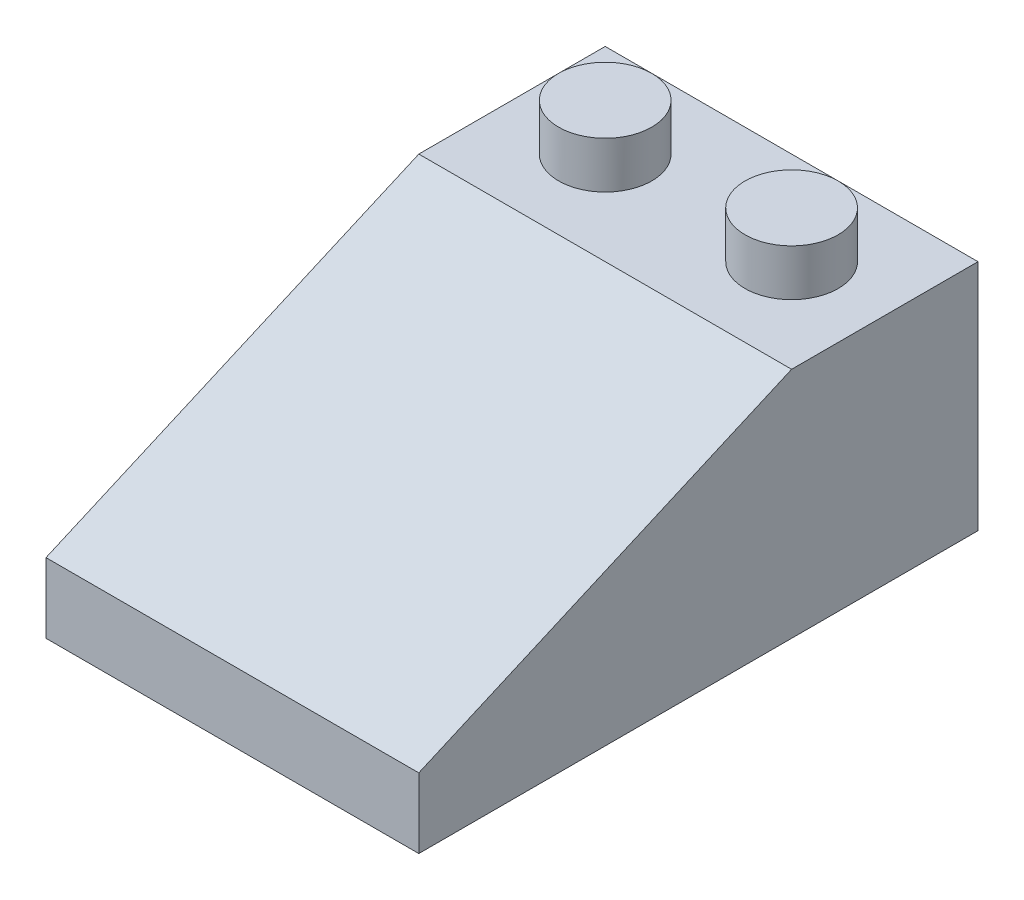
ISO-10303-21;
HEADER;
FILE_DESCRIPTION(('STEP AP214'),'2;1');
FILE_NAME('part.step','',(''),(''),'','','');
FILE_SCHEMA(('AUTOMOTIVE_DESIGN { 1 0 10303 214 1 1 1 1 }'));
ENDSEC;
DATA;
#1=APPLICATION_CONTEXT('core data for automotive mechanical design processes');
#2=APPLICATION_PROTOCOL_DEFINITION('international standard','automotive_design',2000,#1);
#3=PRODUCT_CONTEXT('',#1,'mechanical');
#4=PRODUCT('Part','Part','',(#3));
#5=PRODUCT_RELATED_PRODUCT_CATEGORY('part','',(#4));
#6=PRODUCT_DEFINITION_FORMATION('','',#4);
#7=PRODUCT_DEFINITION_CONTEXT('part definition',#1,'design');
#8=PRODUCT_DEFINITION('design','',#6,#7);
#9=PRODUCT_DEFINITION_SHAPE('','',#8);
#10=(LENGTH_UNIT() NAMED_UNIT(*) SI_UNIT(.MILLI.,.METRE.));
#11=(NAMED_UNIT(*) PLANE_ANGLE_UNIT() SI_UNIT($,.RADIAN.));
#12=(NAMED_UNIT(*) SI_UNIT($,.STERADIAN.) SOLID_ANGLE_UNIT());
#13=UNCERTAINTY_MEASURE_WITH_UNIT(LENGTH_MEASURE(1.E-05),#10,'distance_accuracy_value','');
#14=(GEOMETRIC_REPRESENTATION_CONTEXT(3) GLOBAL_UNCERTAINTY_ASSIGNED_CONTEXT((#13)) GLOBAL_UNIT_ASSIGNED_CONTEXT((#10,
#11,#12)) REPRESENTATION_CONTEXT('',''));
#15=CARTESIAN_POINT('',(0.,0.,0.));
#16=DIRECTION('',(0.,0.,1.));
#17=DIRECTION('',(1.,0.,0.));
#18=AXIS2_PLACEMENT_3D('',#15,#16,#17);
#19=CARTESIAN_POINT('',(16.,0.,0.));
#20=DIRECTION('',(0.,1.,0.));
#21=DIRECTION('',(0.,0.,1.));
#22=AXIS2_PLACEMENT_3D('',#19,#20,#21);
#23=PLANE('',#22);
#24=DIRECTION('',(0.,0.,-1.));
#25=VECTOR('',#24,1.);
#26=CARTESIAN_POINT('',(0.,0.,0.));
#27=LINE('',#26,#25);
#28=CARTESIAN_POINT('',(0.,0.,24.));
#29=VERTEX_POINT('',#28);
#30=CARTESIAN_POINT('',(0.,0.,0.));
#31=VERTEX_POINT('',#30);
#32=EDGE_CURVE('E207',#29,#31,#27,.T.);
#33=ORIENTED_EDGE('',*,*,#32,.T.);
#34=DIRECTION('',(-1.,0.,0.));
#35=VECTOR('',#34,1.);
#36=CARTESIAN_POINT('',(16.,0.,0.));
#37=LINE('',#36,#35);
#38=CARTESIAN_POINT('',(16.,0.,0.));
#39=VERTEX_POINT('',#38);
#40=EDGE_CURVE('E215',#39,#31,#37,.T.);
#41=ORIENTED_EDGE('',*,*,#40,.F.);
#42=DIRECTION('',(0.,0.,-1.));
#43=VECTOR('',#42,1.);
#44=CARTESIAN_POINT('',(16.,0.,0.));
#45=LINE('',#44,#43);
#46=CARTESIAN_POINT('',(16.,0.,24.));
#47=VERTEX_POINT('',#46);
#48=EDGE_CURVE('E213',#47,#39,#45,.T.);
#49=ORIENTED_EDGE('',*,*,#48,.F.);
#50=DIRECTION('',(-1.,0.,0.));
#51=VECTOR('',#50,1.);
#52=CARTESIAN_POINT('',(16.,0.,24.));
#53=LINE('',#52,#51);
#54=EDGE_CURVE('E227',#47,#29,#53,.T.);
#55=ORIENTED_EDGE('',*,*,#54,.T.);
#56=EDGE_LOOP('',(#33,#41,#49,#55));
#57=FACE_BOUND('',#56,.T.);
#58=DIRECTION('',(0.,0.,-1.));
#59=VECTOR('',#58,1.);
#60=CARTESIAN_POINT('',(1.,0.,0.));
#61=LINE('',#60,#59);
#62=CARTESIAN_POINT('',(1.,0.,23.));
#63=VERTEX_POINT('',#62);
#64=CARTESIAN_POINT('',(1.,0.,1.));
#65=VERTEX_POINT('',#64);
#66=EDGE_CURVE('E170',#63,#65,#61,.T.);
#67=ORIENTED_EDGE('',*,*,#66,.F.);
#68=DIRECTION('',(-1.,0.,0.));
#69=VECTOR('',#68,1.);
#70=CARTESIAN_POINT('',(16.,0.,23.));
#71=LINE('',#70,#69);
#72=CARTESIAN_POINT('',(15.,0.,23.));
#73=VERTEX_POINT('',#72);
#74=EDGE_CURVE('E181',#73,#63,#71,.T.);
#75=ORIENTED_EDGE('',*,*,#74,.F.);
#76=DIRECTION('',(0.,0.,-1.));
#77=VECTOR('',#76,1.);
#78=CARTESIAN_POINT('',(15.,0.,0.));
#79=LINE('',#78,#77);
#80=CARTESIAN_POINT('',(15.,0.,1.));
#81=VERTEX_POINT('',#80);
#82=EDGE_CURVE('E175',#73,#81,#79,.T.);
#83=ORIENTED_EDGE('',*,*,#82,.T.);
#84=DIRECTION('',(-1.,0.,0.));
#85=VECTOR('',#84,1.);
#86=CARTESIAN_POINT('',(16.,0.,1.));
#87=LINE('',#86,#85);
#88=EDGE_CURVE('E189',#81,#65,#87,.T.);
#89=ORIENTED_EDGE('',*,*,#88,.T.);
#90=EDGE_LOOP('',(#67,#75,#83,#89));
#91=FACE_BOUND('',#90,.T.);
#92=ADVANCED_FACE('F44',(#57,#91),#23,.F.);
#93=CARTESIAN_POINT('',(16.,9.99999999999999,0.));
#94=DIRECTION('',(0.,-1.,0.));
#95=DIRECTION('',(0.,0.,-1.));
#96=AXIS2_PLACEMENT_3D('',#93,#94,#95);
#97=PLANE('',#96);
#98=CARTESIAN_POINT('',(4.,9.99999999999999,4.));
#99=DIRECTION('',(0.,-1.,0.));
#100=DIRECTION('',(0.,0.,-1.));
#101=AXIS2_PLACEMENT_3D('',#98,#99,#100);
#102=CIRCLE('',#101,2.);
#103=CARTESIAN_POINT('',(4.,9.99999999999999,2.));
#104=VERTEX_POINT('',#103);
#105=EDGE_CURVE('E239',#104,#104,#102,.F.);
#106=ORIENTED_EDGE('',*,*,#105,.F.);
#107=EDGE_LOOP('',(#106));
#108=FACE_BOUND('',#107,.T.);
#109=DIRECTION('',(0.,0.,1.));
#110=VECTOR('',#109,1.);
#111=CARTESIAN_POINT('',(0.,9.99999999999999,0.));
#112=LINE('',#111,#110);
#113=CARTESIAN_POINT('',(0.,9.99999999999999,0.));
#114=VERTEX_POINT('',#113);
#115=CARTESIAN_POINT('',(0.,9.99999999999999,8.));
#116=VERTEX_POINT('',#115);
#117=EDGE_CURVE('E218',#114,#116,#112,.T.);
#118=ORIENTED_EDGE('',*,*,#117,.T.);
#119=DIRECTION('',(-1.,0.,0.));
#120=VECTOR('',#119,1.);
#121=CARTESIAN_POINT('',(16.,9.99999999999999,8.));
#122=LINE('',#121,#120);
#123=CARTESIAN_POINT('',(16.,9.99999999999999,8.));
#124=VERTEX_POINT('',#123);
#125=EDGE_CURVE('E233',#124,#116,#122,.T.);
#126=ORIENTED_EDGE('',*,*,#125,.F.);
#127=DIRECTION('',(0.,0.,1.));
#128=VECTOR('',#127,1.);
#129=CARTESIAN_POINT('',(16.,9.99999999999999,0.));
#130=LINE('',#129,#128);
#131=CARTESIAN_POINT('',(16.,9.99999999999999,0.));
#132=VERTEX_POINT('',#131);
#133=EDGE_CURVE('E206',#132,#124,#130,.T.);
#134=ORIENTED_EDGE('',*,*,#133,.F.);
#135=DIRECTION('',(-1.,0.,0.));
#136=VECTOR('',#135,1.);
#137=CARTESIAN_POINT('',(16.,9.99999999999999,0.));
#138=LINE('',#137,#136);
#139=EDGE_CURVE('E236',#132,#114,#138,.T.);
#140=ORIENTED_EDGE('',*,*,#139,.T.);
#141=EDGE_LOOP('',(#118,#126,#134,#140));
#142=FACE_BOUND('',#141,.T.);
#143=CARTESIAN_POINT('',(12.,9.99999999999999,4.));
#144=DIRECTION('',(0.,-1.,0.));
#145=DIRECTION('',(0.,0.,-1.));
#146=AXIS2_PLACEMENT_3D('',#143,#144,#145);
#147=CIRCLE('',#146,2.);
#148=CARTESIAN_POINT('',(12.,9.99999999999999,2.));
#149=VERTEX_POINT('',#148);
#150=EDGE_CURVE('E52',#149,#149,#147,.F.);
#151=ORIENTED_EDGE('',*,*,#150,.F.);
#152=EDGE_LOOP('',(#151));
#153=FACE_BOUND('',#152,.T.);
#154=ADVANCED_FACE('F246',(#108,#142,#153),#97,.F.);
#155=CARTESIAN_POINT('',(16.,0.,0.));
#156=DIRECTION('',(0.,0.,1.));
#157=DIRECTION('',(1.,0.,0.));
#158=AXIS2_PLACEMENT_3D('',#155,#156,#157);
#159=PLANE('',#158);
#160=DIRECTION('',(0.,1.,0.));
#161=VECTOR('',#160,1.);
#162=CARTESIAN_POINT('',(0.,0.,0.));
#163=LINE('',#162,#161);
#164=EDGE_CURVE('E202',#31,#114,#163,.T.);
#165=ORIENTED_EDGE('',*,*,#164,.T.);
#166=ORIENTED_EDGE('',*,*,#139,.F.);
#167=DIRECTION('',(0.,1.,0.));
#168=VECTOR('',#167,1.);
#169=CARTESIAN_POINT('',(16.,0.,0.));
#170=LINE('',#169,#168);
#171=EDGE_CURVE('E203',#39,#132,#170,.T.);
#172=ORIENTED_EDGE('',*,*,#171,.F.);
#173=ORIENTED_EDGE('',*,*,#40,.T.);
#174=EDGE_LOOP('',(#165,#166,#172,#173));
#175=FACE_BOUND('',#174,.T.);
#176=ADVANCED_FACE('F46',(#175),#159,.F.);
#177=CARTESIAN_POINT('',(16.,9.99999999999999,8.));
#178=DIRECTION('',(0.,-0.916157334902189,-0.400818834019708));
#179=DIRECTION('',(0.,0.400818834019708,-0.916157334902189));
#180=AXIS2_PLACEMENT_3D('',#177,#178,#179);
#181=PLANE('',#180);
#182=DIRECTION('',(0.,-0.400818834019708,0.916157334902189));
#183=VECTOR('',#182,1.);
#184=CARTESIAN_POINT('',(0.,9.99999999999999,8.));
#185=LINE('',#184,#183);
#186=CARTESIAN_POINT('',(0.,3.,24.));
#187=VERTEX_POINT('',#186);
#188=EDGE_CURVE('E220',#116,#187,#185,.T.);
#189=ORIENTED_EDGE('',*,*,#188,.T.);
#190=DIRECTION('',(-1.,0.,0.));
#191=VECTOR('',#190,1.);
#192=CARTESIAN_POINT('',(16.,3.,24.));
#193=LINE('',#192,#191);
#194=CARTESIAN_POINT('',(16.,3.,24.));
#195=VERTEX_POINT('',#194);
#196=EDGE_CURVE('E230',#195,#187,#193,.T.);
#197=ORIENTED_EDGE('',*,*,#196,.F.);
#198=DIRECTION('',(0.,-0.400818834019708,0.916157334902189));
#199=VECTOR('',#198,1.);
#200=CARTESIAN_POINT('',(16.,9.99999999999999,8.));
#201=LINE('',#200,#199);
#202=EDGE_CURVE('E209',#124,#195,#201,.T.);
#203=ORIENTED_EDGE('',*,*,#202,.F.);
#204=ORIENTED_EDGE('',*,*,#125,.T.);
#205=EDGE_LOOP('',(#189,#197,#203,#204));
#206=FACE_BOUND('',#205,.T.);
#207=ADVANCED_FACE('F253',(#206),#181,.F.);
#208=CARTESIAN_POINT('',(16.,0.,24.));
#209=DIRECTION('',(0.,0.,-1.));
#210=DIRECTION('',(-1.,0.,0.));
#211=AXIS2_PLACEMENT_3D('',#208,#209,#210);
#212=PLANE('',#211);
#213=DIRECTION('',(0.,-1.,0.));
#214=VECTOR('',#213,1.);
#215=CARTESIAN_POINT('',(0.,0.,24.));
#216=LINE('',#215,#214);
#217=EDGE_CURVE('E222',#187,#29,#216,.T.);
#218=ORIENTED_EDGE('',*,*,#217,.T.);
#219=ORIENTED_EDGE('',*,*,#54,.F.);
#220=DIRECTION('',(0.,-1.,0.));
#221=VECTOR('',#220,1.);
#222=CARTESIAN_POINT('',(16.,0.,24.));
#223=LINE('',#222,#221);
#224=EDGE_CURVE('E211',#195,#47,#223,.T.);
#225=ORIENTED_EDGE('',*,*,#224,.F.);
#226=ORIENTED_EDGE('',*,*,#196,.T.);
#227=EDGE_LOOP('',(#218,#219,#225,#226));
#228=FACE_BOUND('',#227,.T.);
#229=ADVANCED_FACE('F262',(#228),#212,.F.);
#230=CARTESIAN_POINT('',(16.,0.,0.));
#231=DIRECTION('',(1.,0.,0.));
#232=DIRECTION('',(0.,0.,-1.));
#233=AXIS2_PLACEMENT_3D('',#230,#231,#232);
#234=PLANE('',#233);
#235=ORIENTED_EDGE('',*,*,#171,.T.);
#236=ORIENTED_EDGE('',*,*,#133,.T.);
#237=ORIENTED_EDGE('',*,*,#202,.T.);
#238=ORIENTED_EDGE('',*,*,#224,.T.);
#239=ORIENTED_EDGE('',*,*,#48,.T.);
#240=EDGE_LOOP('',(#235,#236,#237,#238,#239));
#241=FACE_BOUND('',#240,.T.);
#242=ADVANCED_FACE('F265',(#241),#234,.T.);
#243=CARTESIAN_POINT('',(0.,0.,0.));
#244=DIRECTION('',(1.,0.,0.));
#245=DIRECTION('',(0.,0.,-1.));
#246=AXIS2_PLACEMENT_3D('',#243,#244,#245);
#247=PLANE('',#246);
#248=ORIENTED_EDGE('',*,*,#164,.F.);
#249=ORIENTED_EDGE('',*,*,#32,.F.);
#250=ORIENTED_EDGE('',*,*,#217,.F.);
#251=ORIENTED_EDGE('',*,*,#188,.F.);
#252=ORIENTED_EDGE('',*,*,#117,.F.);
#253=EDGE_LOOP('',(#248,#249,#250,#251,#252));
#254=FACE_BOUND('',#253,.T.);
#255=ADVANCED_FACE('F268',(#254),#247,.F.);
#256=CARTESIAN_POINT('',(4.,12.,4.));
#257=DIRECTION('',(0.,-1.,0.));
#258=DIRECTION('',(0.,0.,-1.));
#259=AXIS2_PLACEMENT_3D('',#256,#257,#258);
#260=CYLINDRICAL_SURFACE('',#259,2.);
#261=CARTESIAN_POINT('',(4.,12.,4.));
#262=DIRECTION('',(0.,1.,0.));
#263=DIRECTION('',(0.,0.,1.));
#264=AXIS2_PLACEMENT_3D('',#261,#262,#263);
#265=CIRCLE('',#264,2.);
#266=CARTESIAN_POINT('',(4.,12.,6.));
#267=VERTEX_POINT('',#266);
#268=EDGE_CURVE('E199',#267,#267,#265,.T.);
#269=ORIENTED_EDGE('',*,*,#268,.F.);
#270=EDGE_LOOP('',(#269));
#271=FACE_BOUND('',#270,.T.);
#272=ORIENTED_EDGE('',*,*,#105,.T.);
#273=EDGE_LOOP('',(#272));
#274=FACE_BOUND('',#273,.T.);
#275=ADVANCED_FACE('F271',(#271,#274),#260,.T.);
#276=CARTESIAN_POINT('',(4.,12.,4.));
#277=DIRECTION('',(0.,1.,0.));
#278=DIRECTION('',(0.,0.,1.));
#279=AXIS2_PLACEMENT_3D('',#276,#277,#278);
#280=PLANE('',#279);
#281=ORIENTED_EDGE('',*,*,#268,.T.);
#282=EDGE_LOOP('',(#281));
#283=FACE_BOUND('',#282,.T.);
#284=ADVANCED_FACE('F278',(#283),#280,.T.);
#285=CARTESIAN_POINT('',(12.,12.,4.));
#286=DIRECTION('',(0.,-1.,0.));
#287=DIRECTION('',(0.,0.,-1.));
#288=AXIS2_PLACEMENT_3D('',#285,#286,#287);
#289=CYLINDRICAL_SURFACE('',#288,2.);
#290=CARTESIAN_POINT('',(12.,12.,4.));
#291=DIRECTION('',(0.,1.,0.));
#292=DIRECTION('',(0.,0.,-1.));
#293=AXIS2_PLACEMENT_3D('',#290,#291,#292);
#294=CIRCLE('',#293,2.);
#295=CARTESIAN_POINT('',(12.,12.,2.));
#296=VERTEX_POINT('',#295);
#297=EDGE_CURVE('E163',#296,#296,#294,.T.);
#298=ORIENTED_EDGE('',*,*,#297,.F.);
#299=EDGE_LOOP('',(#298));
#300=FACE_BOUND('',#299,.T.);
#301=ORIENTED_EDGE('',*,*,#150,.T.);
#302=EDGE_LOOP('',(#301));
#303=FACE_BOUND('',#302,.T.);
#304=ADVANCED_FACE('F244',(#300,#303),#289,.T.);
#305=CARTESIAN_POINT('',(12.,12.,4.));
#306=DIRECTION('',(0.,-1.,0.));
#307=DIRECTION('',(0.,0.,-1.));
#308=AXIS2_PLACEMENT_3D('',#305,#306,#307);
#309=PLANE('',#308);
#310=ORIENTED_EDGE('',*,*,#297,.T.);
#311=EDGE_LOOP('',(#310));
#312=FACE_BOUND('',#311,.T.);
#313=ADVANCED_FACE('F285',(#312),#309,.F.);
#314=CARTESIAN_POINT('',(16.,8.99999999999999,0.));
#315=DIRECTION('',(0.,-1.,0.));
#316=DIRECTION('',(0.,0.,-1.));
#317=AXIS2_PLACEMENT_3D('',#314,#315,#316);
#318=PLANE('',#317);
#319=CARTESIAN_POINT('',(8.,9.00000000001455,8.));
#320=DIRECTION('',(0.,-1.,0.));
#321=DIRECTION('',(0.,0.,-1.));
#322=AXIS2_PLACEMENT_3D('',#319,#320,#321);
#323=CIRCLE('',#322,2.7);
#324=CARTESIAN_POINT('',(10.6918849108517,8.99999999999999,7.79082154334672));
#325=VERTEX_POINT('',#324);
#326=CARTESIAN_POINT('',(5.3081150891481,9.00000000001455,7.79082154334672));
#327=VERTEX_POINT('',#326);
#328=EDGE_CURVE('E188',#325,#327,#323,.F.);
#329=ORIENTED_EDGE('',*,*,#328,.T.);
#330=DIRECTION('',(-1.,0.,0.));
#331=VECTOR('',#330,1.);
#332=CARTESIAN_POINT('',(16.,8.99999999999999,7.79082154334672));
#333=LINE('',#332,#331);
#334=CARTESIAN_POINT('',(1.,8.99999999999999,7.79082154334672));
#335=VERTEX_POINT('',#334);
#336=EDGE_CURVE('E145',#327,#335,#333,.T.);
#337=ORIENTED_EDGE('',*,*,#336,.T.);
#338=DIRECTION('',(0.,0.,1.));
#339=VECTOR('',#338,1.);
#340=CARTESIAN_POINT('',(1.,8.99999999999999,0.));
#341=LINE('',#340,#339);
#342=CARTESIAN_POINT('',(1.,8.99999999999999,1.));
#343=VERTEX_POINT('',#342);
#344=EDGE_CURVE('E151',#343,#335,#341,.T.);
#345=ORIENTED_EDGE('',*,*,#344,.F.);
#346=DIRECTION('',(-1.,0.,0.));
#347=VECTOR('',#346,1.);
#348=CARTESIAN_POINT('',(16.,8.99999999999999,1.));
#349=LINE('',#348,#347);
#350=CARTESIAN_POINT('',(15.,8.99999999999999,1.));
#351=VERTEX_POINT('',#350);
#352=EDGE_CURVE('E147',#351,#343,#349,.T.);
#353=ORIENTED_EDGE('',*,*,#352,.F.);
#354=DIRECTION('',(0.,0.,1.));
#355=VECTOR('',#354,1.);
#356=CARTESIAN_POINT('',(15.,8.99999999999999,0.));
#357=LINE('',#356,#355);
#358=CARTESIAN_POINT('',(15.,8.99999999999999,7.79082154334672));
#359=VERTEX_POINT('',#358);
#360=EDGE_CURVE('E153',#351,#359,#357,.T.);
#361=ORIENTED_EDGE('',*,*,#360,.T.);
#362=EDGE_CURVE('E144',#359,#325,#333,.T.);
#363=ORIENTED_EDGE('',*,*,#362,.T.);
#364=EDGE_LOOP('',(#329,#337,#345,#353,#361,#363));
#365=FACE_BOUND('',#364,.T.);
#366=CARTESIAN_POINT('',(4.,8.99999999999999,4.));
#367=DIRECTION('',(0.,-1.,0.));
#368=DIRECTION('',(0.,0.,-1.));
#369=AXIS2_PLACEMENT_3D('',#366,#367,#368);
#370=CIRCLE('',#369,1.);
#371=CARTESIAN_POINT('',(4.,8.99999999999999,3.));
#372=VERTEX_POINT('',#371);
#373=EDGE_CURVE('E159',#372,#372,#370,.F.);
#374=ORIENTED_EDGE('',*,*,#373,.T.);
#375=EDGE_LOOP('',(#374));
#376=FACE_BOUND('',#375,.T.);
#377=CARTESIAN_POINT('',(12.,8.99999999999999,4.));
#378=DIRECTION('',(0.,-1.,0.));
#379=DIRECTION('',(0.,0.,-1.));
#380=AXIS2_PLACEMENT_3D('',#377,#378,#379);
#381=CIRCLE('',#380,0.999999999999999);
#382=CARTESIAN_POINT('',(12.,8.99999999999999,3.));
#383=VERTEX_POINT('',#382);
#384=EDGE_CURVE('E160',#383,#383,#381,.F.);
#385=ORIENTED_EDGE('',*,*,#384,.T.);
#386=EDGE_LOOP('',(#385));
#387=FACE_BOUND('',#386,.T.);
#388=ADVANCED_FACE('F289',(#365,#376,#387),#318,.T.);
#389=CARTESIAN_POINT('',(16.,0.,1.));
#390=DIRECTION('',(0.,0.,1.));
#391=DIRECTION('',(1.,0.,0.));
#392=AXIS2_PLACEMENT_3D('',#389,#390,#391);
#393=PLANE('',#392);
#394=DIRECTION('',(0.,1.,0.));
#395=VECTOR('',#394,1.);
#396=CARTESIAN_POINT('',(1.,0.,1.));
#397=LINE('',#396,#395);
#398=EDGE_CURVE('E164',#65,#343,#397,.T.);
#399=ORIENTED_EDGE('',*,*,#398,.F.);
#400=ORIENTED_EDGE('',*,*,#88,.F.);
#401=DIRECTION('',(0.,1.,0.));
#402=VECTOR('',#401,1.);
#403=CARTESIAN_POINT('',(15.,0.,1.));
#404=LINE('',#403,#402);
#405=EDGE_CURVE('E156',#81,#351,#404,.T.);
#406=ORIENTED_EDGE('',*,*,#405,.T.);
#407=ORIENTED_EDGE('',*,*,#352,.T.);
#408=EDGE_LOOP('',(#399,#400,#406,#407));
#409=FACE_BOUND('',#408,.T.);
#410=ADVANCED_FACE('F323',(#409),#393,.T.);
#411=CARTESIAN_POINT('',(16.,9.08384266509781,7.59918116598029));
#412=DIRECTION('',(0.,-0.916157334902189,-0.400818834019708));
#413=DIRECTION('',(0.,0.400818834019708,-0.916157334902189));
#414=AXIS2_PLACEMENT_3D('',#411,#412,#413);
#415=PLANE('',#414);
#416=CARTESIAN_POINT('',(8.,5.40848442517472,16.));
#417=DIRECTION('',(0.,-0.916157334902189,-0.400818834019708));
#418=DIRECTION('',(0.,-0.400818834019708,0.916157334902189));
#419=AXIS2_PLACEMENT_3D('',#416,#417,#418);
#420=ELLIPSE('',#419,2.94709205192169,2.7);
#421=CARTESIAN_POINT('',(8.,4.22723442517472,18.7));
#422=VERTEX_POINT('',#421);
#423=EDGE_CURVE('E12',#422,#422,#420,.T.);
#424=ORIENTED_EDGE('',*,*,#423,.F.);
#425=EDGE_LOOP('',(#424));
#426=FACE_BOUND('',#425,.T.);
#427=CARTESIAN_POINT('',(8.,8.90848442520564,8.));
#428=DIRECTION('',(0.,-0.916157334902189,-0.400818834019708));
#429=DIRECTION('',(0.,-0.400818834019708,0.916157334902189));
#430=AXIS2_PLACEMENT_3D('',#427,#428,#429);
#431=ELLIPSE('',#430,2.94709205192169,2.7);
#432=EDGE_CURVE('E66',#327,#325,#431,.F.);
#433=ORIENTED_EDGE('',*,*,#432,.T.);
#434=ORIENTED_EDGE('',*,*,#362,.F.);
#435=DIRECTION('',(0.,-0.400818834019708,0.916157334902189));
#436=VECTOR('',#435,1.);
#437=CARTESIAN_POINT('',(15.,9.08384266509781,7.59918116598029));
#438=LINE('',#437,#436);
#439=CARTESIAN_POINT('',(15.,2.34598442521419,23.));
#440=VERTEX_POINT('',#439);
#441=EDGE_CURVE('E155',#359,#440,#438,.T.);
#442=ORIENTED_EDGE('',*,*,#441,.T.);
#443=DIRECTION('',(-1.,0.,0.));
#444=VECTOR('',#443,1.);
#445=CARTESIAN_POINT('',(16.,2.34598442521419,23.));
#446=LINE('',#445,#444);
#447=CARTESIAN_POINT('',(1.,2.34598442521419,23.));
#448=VERTEX_POINT('',#447);
#449=EDGE_CURVE('E148',#440,#448,#446,.T.);
#450=ORIENTED_EDGE('',*,*,#449,.T.);
#451=DIRECTION('',(0.,-0.400818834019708,0.916157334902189));
#452=VECTOR('',#451,1.);
#453=CARTESIAN_POINT('',(1.,9.08384266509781,7.59918116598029));
#454=LINE('',#453,#452);
#455=EDGE_CURVE('E176',#335,#448,#454,.T.);
#456=ORIENTED_EDGE('',*,*,#455,.F.);
#457=ORIENTED_EDGE('',*,*,#336,.F.);
#458=EDGE_LOOP('',(#433,#434,#442,#450,#456,#457));
#459=FACE_BOUND('',#458,.T.);
#460=ADVANCED_FACE('F319',(#426,#459),#415,.T.);
#461=CARTESIAN_POINT('',(16.,0.,23.));
#462=DIRECTION('',(0.,0.,-1.));
#463=DIRECTION('',(-1.,0.,0.));
#464=AXIS2_PLACEMENT_3D('',#461,#462,#463);
#465=PLANE('',#464);
#466=DIRECTION('',(0.,-1.,0.));
#467=VECTOR('',#466,1.);
#468=CARTESIAN_POINT('',(1.,0.,23.));
#469=LINE('',#468,#467);
#470=EDGE_CURVE('E178',#448,#63,#469,.T.);
#471=ORIENTED_EDGE('',*,*,#470,.F.);
#472=ORIENTED_EDGE('',*,*,#449,.F.);
#473=DIRECTION('',(0.,-1.,0.));
#474=VECTOR('',#473,1.);
#475=CARTESIAN_POINT('',(15.,0.,23.));
#476=LINE('',#475,#474);
#477=EDGE_CURVE('E172',#440,#73,#476,.T.);
#478=ORIENTED_EDGE('',*,*,#477,.T.);
#479=ORIENTED_EDGE('',*,*,#74,.T.);
#480=EDGE_LOOP('',(#471,#472,#478,#479));
#481=FACE_BOUND('',#480,.T.);
#482=ADVANCED_FACE('F315',(#481),#465,.T.);
#483=CARTESIAN_POINT('',(15.,0.,0.));
#484=DIRECTION('',(1.,0.,0.));
#485=DIRECTION('',(0.,0.,-1.));
#486=AXIS2_PLACEMENT_3D('',#483,#484,#485);
#487=PLANE('',#486);
#488=ORIENTED_EDGE('',*,*,#405,.F.);
#489=ORIENTED_EDGE('',*,*,#82,.F.);
#490=ORIENTED_EDGE('',*,*,#477,.F.);
#491=ORIENTED_EDGE('',*,*,#441,.F.);
#492=ORIENTED_EDGE('',*,*,#360,.F.);
#493=EDGE_LOOP('',(#488,#489,#490,#491,#492));
#494=FACE_BOUND('',#493,.T.);
#495=ADVANCED_FACE('F311',(#494),#487,.F.);
#496=CARTESIAN_POINT('',(1.,0.,0.));
#497=DIRECTION('',(1.,0.,0.));
#498=DIRECTION('',(0.,0.,-1.));
#499=AXIS2_PLACEMENT_3D('',#496,#497,#498);
#500=PLANE('',#499);
#501=ORIENTED_EDGE('',*,*,#398,.T.);
#502=ORIENTED_EDGE('',*,*,#344,.T.);
#503=ORIENTED_EDGE('',*,*,#455,.T.);
#504=ORIENTED_EDGE('',*,*,#470,.T.);
#505=ORIENTED_EDGE('',*,*,#66,.T.);
#506=EDGE_LOOP('',(#501,#502,#503,#504,#505));
#507=FACE_BOUND('',#506,.T.);
#508=ADVANCED_FACE('F307',(#507),#500,.T.);
#509=CARTESIAN_POINT('',(4.,12.,4.));
#510=DIRECTION('',(0.,-1.,0.));
#511=DIRECTION('',(0.,0.,-1.));
#512=AXIS2_PLACEMENT_3D('',#509,#510,#511);
#513=CYLINDRICAL_SURFACE('',#512,1.);
#514=CARTESIAN_POINT('',(4.,11.,4.));
#515=DIRECTION('',(0.,1.,0.));
#516=DIRECTION('',(0.,0.,1.));
#517=AXIS2_PLACEMENT_3D('',#514,#515,#516);
#518=CIRCLE('',#517,1.);
#519=CARTESIAN_POINT('',(4.,11.,5.));
#520=VERTEX_POINT('',#519);
#521=EDGE_CURVE('E167',#520,#520,#518,.T.);
#522=ORIENTED_EDGE('',*,*,#521,.T.);
#523=EDGE_LOOP('',(#522));
#524=FACE_BOUND('',#523,.T.);
#525=ORIENTED_EDGE('',*,*,#373,.F.);
#526=EDGE_LOOP('',(#525));
#527=FACE_BOUND('',#526,.T.);
#528=ADVANCED_FACE('F303',(#524,#527),#513,.F.);
#529=CARTESIAN_POINT('',(4.,11.,4.));
#530=DIRECTION('',(0.,1.,0.));
#531=DIRECTION('',(0.,0.,1.));
#532=AXIS2_PLACEMENT_3D('',#529,#530,#531);
#533=PLANE('',#532);
#534=ORIENTED_EDGE('',*,*,#521,.F.);
#535=EDGE_LOOP('',(#534));
#536=FACE_BOUND('',#535,.T.);
#537=ADVANCED_FACE('F299',(#536),#533,.F.);
#538=CARTESIAN_POINT('',(12.,12.,4.));
#539=DIRECTION('',(0.,-1.,0.));
#540=DIRECTION('',(0.,0.,-1.));
#541=AXIS2_PLACEMENT_3D('',#538,#539,#540);
#542=CYLINDRICAL_SURFACE('',#541,0.999999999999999);
#543=CARTESIAN_POINT('',(12.,11.,4.));
#544=DIRECTION('',(0.,-1.,0.));
#545=DIRECTION('',(0.,0.,-1.));
#546=AXIS2_PLACEMENT_3D('',#543,#544,#545);
#547=CIRCLE('',#546,0.999999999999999);
#548=CARTESIAN_POINT('',(12.,11.,3.));
#549=VERTEX_POINT('',#548);
#550=EDGE_CURVE('E185',#549,#549,#547,.F.);
#551=ORIENTED_EDGE('',*,*,#550,.T.);
#552=EDGE_LOOP('',(#551));
#553=FACE_BOUND('',#552,.T.);
#554=ORIENTED_EDGE('',*,*,#384,.F.);
#555=EDGE_LOOP('',(#554));
#556=FACE_BOUND('',#555,.T.);
#557=ADVANCED_FACE('F295',(#553,#556),#542,.F.);
#558=CARTESIAN_POINT('',(12.,11.,4.));
#559=DIRECTION('',(0.,-1.,0.));
#560=DIRECTION('',(0.,0.,-1.));
#561=AXIS2_PLACEMENT_3D('',#558,#559,#560);
#562=PLANE('',#561);
#563=ORIENTED_EDGE('',*,*,#550,.F.);
#564=EDGE_LOOP('',(#563));
#565=FACE_BOUND('',#564,.T.);
#566=ADVANCED_FACE('F291',(#565),#562,.T.);
#567=CARTESIAN_POINT('',(8.,0.,8.));
#568=DIRECTION('',(0.,-1.,0.));
#569=DIRECTION('',(0.,0.,-1.));
#570=AXIS2_PLACEMENT_3D('',#567,#568,#569);
#571=PLANE('',#570);
#572=CARTESIAN_POINT('',(8.,0.,8.));
#573=DIRECTION('',(0.,-1.,0.));
#574=DIRECTION('',(0.,0.,-1.));
#575=AXIS2_PLACEMENT_3D('',#572,#573,#574);
#576=CIRCLE('',#575,1.7);
#577=CARTESIAN_POINT('',(8.,0.,6.3));
#578=VERTEX_POINT('',#577);
#579=EDGE_CURVE('E141',#578,#578,#576,.T.);
#580=ORIENTED_EDGE('',*,*,#579,.F.);
#581=EDGE_LOOP('',(#580));
#582=FACE_BOUND('',#581,.T.);
#583=CARTESIAN_POINT('',(8.,0.,8.));
#584=DIRECTION('',(0.,-1.,0.));
#585=DIRECTION('',(0.,0.,-1.));
#586=AXIS2_PLACEMENT_3D('',#583,#584,#585);
#587=CIRCLE('',#586,2.7);
#588=CARTESIAN_POINT('',(8.,0.,5.3));
#589=VERTEX_POINT('',#588);
#590=EDGE_CURVE('E539',#589,#589,#587,.T.);
#591=ORIENTED_EDGE('',*,*,#590,.T.);
#592=EDGE_LOOP('',(#591));
#593=FACE_BOUND('',#592,.T.);
#594=ADVANCED_FACE('F294',(#582,#593),#571,.T.);
#595=CARTESIAN_POINT('',(8.,500000.,8.00000000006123));
#596=DIRECTION('',(0.,-1.,0.));
#597=DIRECTION('',(0.,0.,-1.));
#598=AXIS2_PLACEMENT_3D('',#595,#596,#597);
#599=CYLINDRICAL_SURFACE('',#598,2.7);
#600=ORIENTED_EDGE('',*,*,#432,.F.);
#601=ORIENTED_EDGE('',*,*,#328,.F.);
#602=EDGE_LOOP('',(#600,#601));
#603=FACE_BOUND('',#602,.T.);
#604=ORIENTED_EDGE('',*,*,#590,.F.);
#605=EDGE_LOOP('',(#604));
#606=FACE_BOUND('',#605,.T.);
#607=ADVANCED_FACE('F332',(#603,#606),#599,.T.);
#608=CARTESIAN_POINT('',(8.,500000.,8.00000000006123));
#609=DIRECTION('',(0.,-1.,0.));
#610=DIRECTION('',(0.,0.,-1.));
#611=AXIS2_PLACEMENT_3D('',#608,#609,#610);
#612=CYLINDRICAL_SURFACE('',#611,1.7);
#613=CARTESIAN_POINT('',(8.,9.00000000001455,8.));
#614=DIRECTION('',(0.,-1.,0.));
#615=DIRECTION('',(0.,0.,-1.));
#616=AXIS2_PLACEMENT_3D('',#613,#614,#615);
#617=CIRCLE('',#616,1.7);
#618=CARTESIAN_POINT('',(9.68708161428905,9.00000000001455,7.79082154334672));
#619=VERTEX_POINT('',#618);
#620=CARTESIAN_POINT('',(6.31291838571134,8.99999999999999,7.79082154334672));
#621=VERTEX_POINT('',#620);
#622=EDGE_CURVE('E58',#619,#621,#617,.F.);
#623=ORIENTED_EDGE('',*,*,#622,.T.);
#624=CARTESIAN_POINT('',(8.,8.90848442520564,8.));
#625=DIRECTION('',(0.,-0.916157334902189,-0.400818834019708));
#626=DIRECTION('',(0.,-0.400818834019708,0.916157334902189));
#627=AXIS2_PLACEMENT_3D('',#624,#625,#626);
#628=ELLIPSE('',#627,1.85557647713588,1.7);
#629=EDGE_CURVE('E131',#621,#619,#628,.F.);
#630=ORIENTED_EDGE('',*,*,#629,.T.);
#631=EDGE_LOOP('',(#623,#630));
#632=FACE_BOUND('',#631,.T.);
#633=ORIENTED_EDGE('',*,*,#579,.T.);
#634=EDGE_LOOP('',(#633));
#635=FACE_BOUND('',#634,.T.);
#636=ADVANCED_FACE('F132',(#632,#635),#612,.F.);
#637=EDGE_CURVE('E140',#619,#621,#333,.T.);
#638=ORIENTED_EDGE('',*,*,#637,.F.);
#639=ORIENTED_EDGE('',*,*,#629,.F.);
#640=EDGE_LOOP('',(#638,#639));
#641=FACE_BOUND('',#640,.T.);
#642=ADVANCED_FACE('F143',(#641),#415,.T.);
#643=ORIENTED_EDGE('',*,*,#637,.T.);
#644=ORIENTED_EDGE('',*,*,#622,.F.);
#645=EDGE_LOOP('',(#643,#644));
#646=FACE_BOUND('',#645,.T.);
#647=ADVANCED_FACE('F139',(#646),#318,.T.);
#648=CARTESIAN_POINT('',(8.,0.,16.));
#649=DIRECTION('',(0.,1.,0.));
#650=DIRECTION('',(0.,0.,1.));
#651=AXIS2_PLACEMENT_3D('',#648,#649,#650);
#652=PLANE('',#651);
#653=CARTESIAN_POINT('',(8.,0.,16.));
#654=DIRECTION('',(0.,-1.,0.));
#655=DIRECTION('',(0.,0.,1.));
#656=AXIS2_PLACEMENT_3D('',#653,#654,#655);
#657=CIRCLE('',#656,2.7);
#658=CARTESIAN_POINT('',(8.,0.,18.7));
#659=VERTEX_POINT('',#658);
#660=EDGE_CURVE('E545',#659,#659,#657,.T.);
#661=ORIENTED_EDGE('',*,*,#660,.T.);
#662=EDGE_LOOP('',(#661));
#663=FACE_BOUND('',#662,.T.);
#664=CARTESIAN_POINT('',(8.,0.,16.));
#665=DIRECTION('',(0.,-1.,0.));
#666=DIRECTION('',(0.,0.,1.));
#667=AXIS2_PLACEMENT_3D('',#664,#665,#666);
#668=CIRCLE('',#667,1.7);
#669=CARTESIAN_POINT('',(8.,0.,17.7));
#670=VERTEX_POINT('',#669);
#671=EDGE_CURVE('E540',#670,#670,#668,.T.);
#672=ORIENTED_EDGE('',*,*,#671,.F.);
#673=EDGE_LOOP('',(#672));
#674=FACE_BOUND('',#673,.T.);
#675=ADVANCED_FACE('F348',(#663,#674),#652,.F.);
#676=CARTESIAN_POINT('',(8.,500000.,16.0000000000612));
#677=DIRECTION('',(0.,-1.,0.));
#678=DIRECTION('',(0.,0.,-1.));
#679=AXIS2_PLACEMENT_3D('',#676,#677,#678);
#680=CYLINDRICAL_SURFACE('',#679,1.7);
#681=CARTESIAN_POINT('',(8.,5.40848442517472,16.));
#682=DIRECTION('',(0.,-0.916157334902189,-0.400818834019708));
#683=DIRECTION('',(0.,-0.400818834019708,0.916157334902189));
#684=AXIS2_PLACEMENT_3D('',#681,#682,#683);
#685=ELLIPSE('',#684,1.85557647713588,1.7);
#686=CARTESIAN_POINT('',(8.,4.66473442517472,17.7));
#687=VERTEX_POINT('',#686);
#688=EDGE_CURVE('E538',#687,#687,#685,.F.);
#689=ORIENTED_EDGE('',*,*,#688,.T.);
#690=EDGE_LOOP('',(#689));
#691=FACE_BOUND('',#690,.T.);
#692=ORIENTED_EDGE('',*,*,#671,.T.);
#693=EDGE_LOOP('',(#692));
#694=FACE_BOUND('',#693,.T.);
#695=ADVANCED_FACE('F344',(#691,#694),#680,.F.);
#696=CARTESIAN_POINT('',(8.,500000.,16.0000000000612));
#697=DIRECTION('',(0.,-1.,0.));
#698=DIRECTION('',(0.,0.,-1.));
#699=AXIS2_PLACEMENT_3D('',#696,#697,#698);
#700=CYLINDRICAL_SURFACE('',#699,2.7);
#701=ORIENTED_EDGE('',*,*,#423,.T.);
#702=EDGE_LOOP('',(#701));
#703=FACE_BOUND('',#702,.T.);
#704=ORIENTED_EDGE('',*,*,#660,.F.);
#705=EDGE_LOOP('',(#704));
#706=FACE_BOUND('',#705,.T.);
#707=ADVANCED_FACE('F341',(#703,#706),#700,.T.);
#708=ORIENTED_EDGE('',*,*,#688,.F.);
#709=EDGE_LOOP('',(#708));
#710=FACE_BOUND('',#709,.T.);
#711=ADVANCED_FACE('F325',(#710),#415,.T.);
#712=CLOSED_SHELL('',(#92,#154,#176,#207,#229,#242,#255,#275,#284,#304,#313,#388,#410,#460,#482,
#495,#508,#528,#537,#557,#566,#594,#607,#636,#642,#647,#675,#695,#707,#711));
#713=MANIFOLD_SOLID_BREP('B2',#712);
#714=ADVANCED_BREP_SHAPE_REPRESENTATION('',(#18,#713),#14);
#715=SHAPE_DEFINITION_REPRESENTATION(#9,#714);
ENDSEC;
END-ISO-10303-21;
